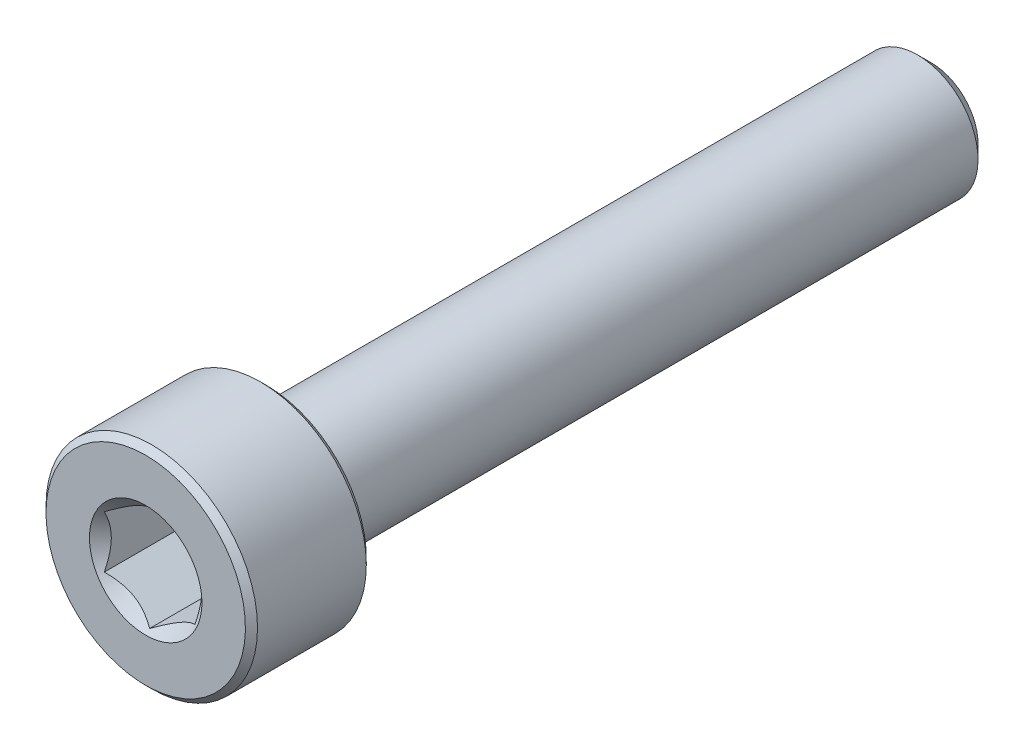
from build123d import *

# Parameters (mm, degrees)
CUT_EXTRUDE1_DEPTH = 3


with BuildPart() as part:
    # Sketch2 → Revolve1 (revolve)
    with BuildSketch(Plane(origin=(0, 0, 0), x_dir=(0, 0, -1), z_dir=(1, 0, 0))):
        with BuildLine():
            Line((-13, 0), (-13, 3.3))
            Line((-13, 3.3), (-12.8, 3.5))
            Line((-12.8, 3.5), (-9.2, 3.5))
            Line((-9.2, 3.5), (-9, 3.3))
            Line((-9, 3.3), (-9, 2.2))
            ThreePointArc((-9, 2.2), (-8.941421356, 2.058578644), (-8.8, 2))
            Line((-8.8, 2), (12.545336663, 2))
            Line((12.545336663, 2), (13, 1.545336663))
            Line((13, 1.545336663), (13, 0))
            Line((13, 0), (-13, 0))
        make_face()
    revolve(axis=Axis((0, 0, -13), (0, 0, 1)))

    # Sketch3 → Cut-Extrude1 (cut)
    with BuildSketch(Plane.XY.offset(13)):
        Polygon((1.5, -0.866025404), (1.5, 0.866025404), (0, 1.732050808), (-1.5, 0.866025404), (-1.5, -0.866025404), (0, -1.732050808), align=None)
    extrude(amount=-CUT_EXTRUDE1_DEPTH, mode=Mode.SUBTRACT)

    # Cut-Extrude2 cone 1 section (on through the dimple's axis) → Cut-Extrude2 (revolve, cut)
    with BuildSketch(Plane(origin=(0, 0, 13), x_dir=(0, -1, 0), z_dir=(1, 0, 0))):
        Polygon((0, 0), (1.861954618, 0), (0, 1.861954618), align=None)
    revolve(axis=Axis((0, 0, 13), (0, 0, -1)), mode=Mode.SUBTRACT)


solid = part.part
